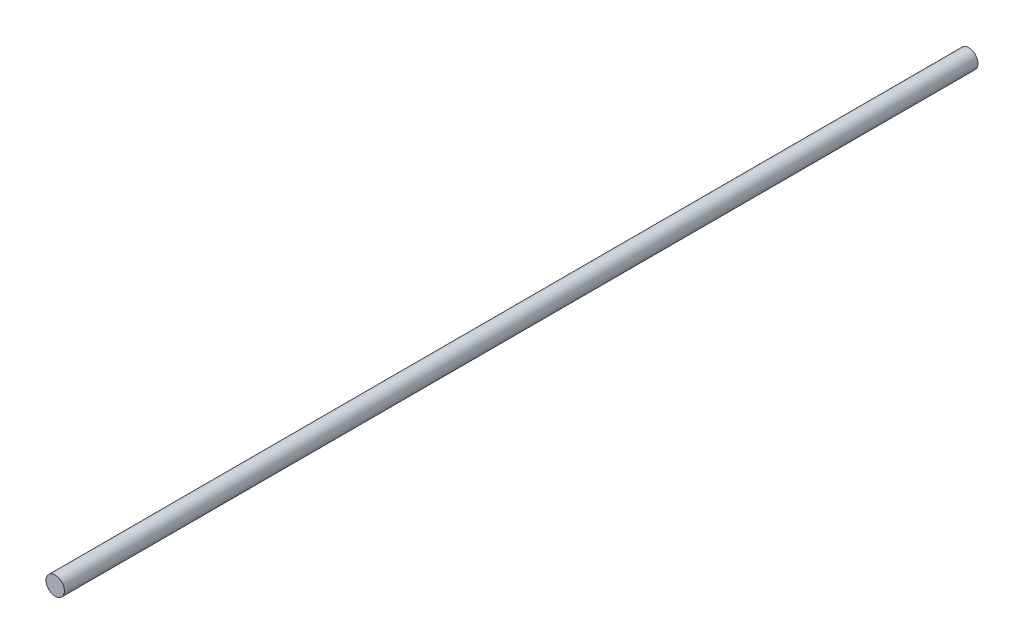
from build123d import *

# Parameters (mm, degrees)
SKETCH2_R           = 0.9779
BOSS_EXTRUDE1_DEPTH = 97


with BuildPart() as part:
    # Sketch2 → Boss-Extrude1 (new body)
    with BuildSketch(Plane.XY):
        with Locations(Location((0, 0, 0), (0, 0, 180))):
            Circle(SKETCH2_R)
    extrude(amount=BOSS_EXTRUDE1_DEPTH)


solid = part.part
